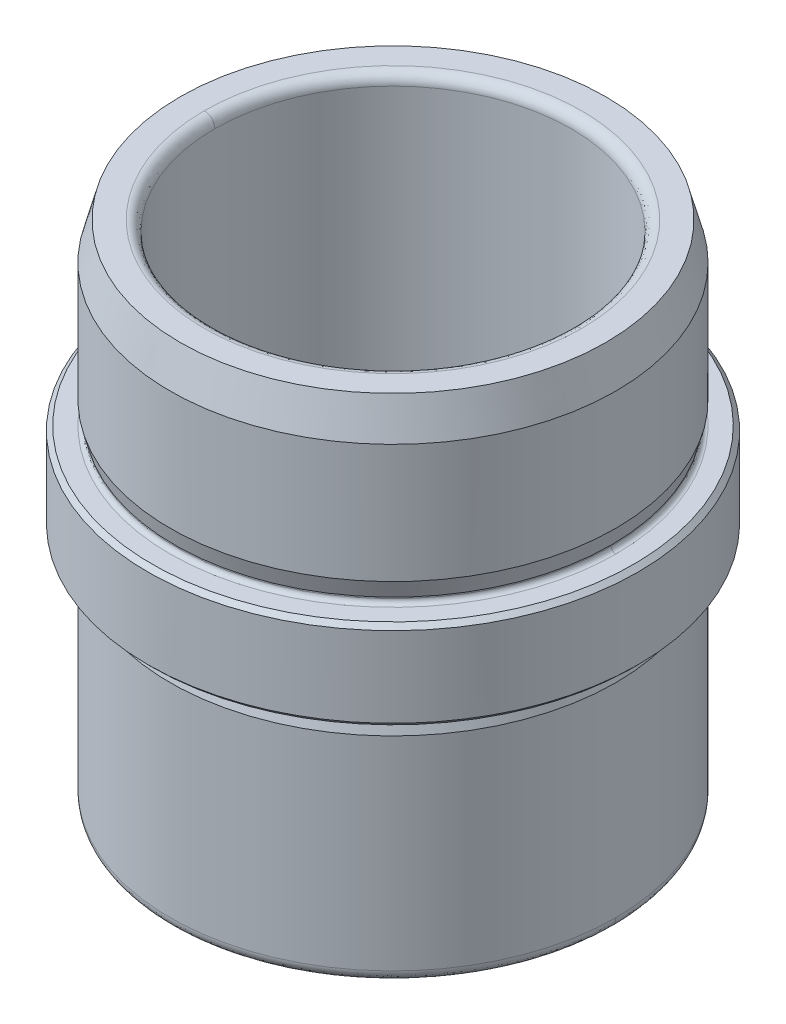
ISO-10303-21;
HEADER;
FILE_DESCRIPTION(('STEP AP214'),'2;1');
FILE_NAME('part.step','',(''),(''),'','','');
FILE_SCHEMA(('AUTOMOTIVE_DESIGN { 1 0 10303 214 1 1 1 1 }'));
ENDSEC;
DATA;
#1=APPLICATION_CONTEXT('core data for automotive mechanical design processes');
#2=APPLICATION_PROTOCOL_DEFINITION('international standard','automotive_design',2000,#1);
#3=PRODUCT_CONTEXT('',#1,'mechanical');
#4=PRODUCT('Part','Part','',(#3));
#5=PRODUCT_RELATED_PRODUCT_CATEGORY('part','',(#4));
#6=PRODUCT_DEFINITION_FORMATION('','',#4);
#7=PRODUCT_DEFINITION_CONTEXT('part definition',#1,'design');
#8=PRODUCT_DEFINITION('design','',#6,#7);
#9=PRODUCT_DEFINITION_SHAPE('','',#8);
#10=(LENGTH_UNIT() NAMED_UNIT(*) SI_UNIT(.MILLI.,.METRE.));
#11=(NAMED_UNIT(*) PLANE_ANGLE_UNIT() SI_UNIT($,.RADIAN.));
#12=(NAMED_UNIT(*) SI_UNIT($,.STERADIAN.) SOLID_ANGLE_UNIT());
#13=UNCERTAINTY_MEASURE_WITH_UNIT(LENGTH_MEASURE(1.E-05),#10,'distance_accuracy_value','');
#14=(GEOMETRIC_REPRESENTATION_CONTEXT(3) GLOBAL_UNCERTAINTY_ASSIGNED_CONTEXT((#13)) GLOBAL_UNIT_ASSIGNED_CONTEXT((#10,
#11,#12)) REPRESENTATION_CONTEXT('',''));
#15=CARTESIAN_POINT('',(0.,0.,0.));
#16=DIRECTION('',(0.,0.,1.));
#17=DIRECTION('',(1.,0.,0.));
#18=AXIS2_PLACEMENT_3D('',#15,#16,#17);
#19=CARTESIAN_POINT('',(45.,-94.7,172.));
#20=DIRECTION('',(0.,-1.,0.));
#21=DIRECTION('',(0.,0.,-1.));
#22=AXIS2_PLACEMENT_3D('',#19,#20,#21);
#23=CYLINDRICAL_SURFACE('',#22,12.);
#24=CARTESIAN_POINT('',(45.,-94.6999999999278,172.));
#25=DIRECTION('',(0.,-1.,0.));
#26=DIRECTION('',(0.,0.,-1.));
#27=AXIS2_PLACEMENT_3D('',#24,#25,#26);
#28=CIRCLE('',#27,11.9999999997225);
#29=CARTESIAN_POINT('',(56.9999999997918,-94.6999999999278,171.999999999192));
#30=VERTEX_POINT('',#29);
#31=CARTESIAN_POINT('',(33.0000000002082,-94.6999999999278,171.999999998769));
#32=VERTEX_POINT('',#31);
#33=EDGE_CURVE('E100',#30,#32,#28,.T.);
#34=ORIENTED_EDGE('',*,*,#33,.F.);
#35=CARTESIAN_POINT('',(45.,-94.6999999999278,172.));
#36=DIRECTION('',(0.,-1.,0.));
#37=DIRECTION('',(0.,0.,-1.));
#38=AXIS2_PLACEMENT_3D('',#35,#36,#37);
#39=CIRCLE('',#38,11.9999999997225);
#40=EDGE_CURVE('E520',#32,#30,#39,.T.);
#41=ORIENTED_EDGE('',*,*,#40,.F.);
#42=EDGE_LOOP('',(#34,#41));
#43=FACE_BOUND('',#42,.T.);
#44=CARTESIAN_POINT('',(45.,-127.000000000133,172.));
#45=DIRECTION('',(0.,1.,0.));
#46=DIRECTION('',(0.,0.,1.));
#47=AXIS2_PLACEMENT_3D('',#44,#45,#46);
#48=CIRCLE('',#47,12.0000000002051);
#49=CARTESIAN_POINT('',(57.0000000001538,-127.0000000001,171.999999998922));
#50=VERTEX_POINT('',#49);
#51=CARTESIAN_POINT('',(32.9999999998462,-127.0000000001,171.999999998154));
#52=VERTEX_POINT('',#51);
#53=EDGE_CURVE('E116',#50,#52,#48,.T.);
#54=ORIENTED_EDGE('',*,*,#53,.F.);
#55=CARTESIAN_POINT('',(45.,-127.000000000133,172.));
#56=DIRECTION('',(0.,1.,0.));
#57=DIRECTION('',(0.,0.,1.));
#58=AXIS2_PLACEMENT_3D('',#55,#56,#57);
#59=CIRCLE('',#58,12.0000000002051);
#60=EDGE_CURVE('E105',#52,#50,#59,.T.);
#61=ORIENTED_EDGE('',*,*,#60,.F.);
#62=EDGE_LOOP('',(#54,#61));
#63=FACE_BOUND('',#62,.T.);
#64=ADVANCED_FACE('F24',(#43,#63),#23,.F.);
#65=CARTESIAN_POINT('',(31.900166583,-127.995004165,172.));
#66=CARTESIAN_POINT('',(31.900166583,-127.995004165,198.199666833));
#67=CARTESIAN_POINT('',(58.099833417,-127.995004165,198.199666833));
#68=CARTESIAN_POINT('',(58.099833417,-127.995004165,172.));
#69=CARTESIAN_POINT('',(32.580053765,-128.063220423,172.));
#70=CARTESIAN_POINT('',(32.580053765,-128.063220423,196.83989247));
#71=CARTESIAN_POINT('',(57.419946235,-128.063220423,196.83989247));
#72=CARTESIAN_POINT('',(57.419946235,-128.063220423,172.));
#73=CARTESIAN_POINT('',(33.063220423,-127.580053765,172.));
#74=CARTESIAN_POINT('',(33.063220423,-127.580053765,195.873559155));
#75=CARTESIAN_POINT('',(56.936779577,-127.580053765,195.873559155));
#76=CARTESIAN_POINT('',(56.936779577,-127.580053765,172.));
#77=CARTESIAN_POINT('',(32.995004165,-126.900166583,172.));
#78=CARTESIAN_POINT('',(32.995004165,-126.900166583,196.009991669));
#79=CARTESIAN_POINT('',(57.004995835,-126.900166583,196.009991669));
#80=CARTESIAN_POINT('',(57.004995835,-126.900166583,172.));
#81=(BOUNDED_SURFACE() B_SPLINE_SURFACE(3,3,((#65,#66,#67,#68),(#69,#70,#71,#72),(#73,#74,#75,
#76),(#77,#78,#79,#80)),.UNSPECIFIED.,.F.,.F.,.F.) B_SPLINE_SURFACE_WITH_KNOTS((4,4),(4,4),(0.,
1.),(0.,1.),.UNSPECIFIED.) GEOMETRIC_REPRESENTATION_ITEM() RATIONAL_B_SPLINE_SURFACE(((1.,
0.333333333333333,0.333333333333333,1.),(0.755320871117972,0.251773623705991,0.251773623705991,
0.755320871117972),(0.755320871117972,0.251773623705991,0.251773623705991,0.755320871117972),
(1.,0.333333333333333,0.333333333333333,1.))) REPRESENTATION_ITEM('') SURFACE());
#82=CARTESIAN_POINT('',(58.099833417,-127.995004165,172.));
#83=CARTESIAN_POINT('',(57.419946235,-128.063220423,172.));
#84=CARTESIAN_POINT('',(56.936779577,-127.580053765,172.));
#85=CARTESIAN_POINT('',(57.004995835,-126.900166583,172.));
#86=(BOUNDED_CURVE() B_SPLINE_CURVE(3,(#82,#83,#84,#85),.UNSPECIFIED.,.F.,
.F.) B_SPLINE_CURVE_WITH_KNOTS((4,4),(0.,1.),
.UNSPECIFIED.) CURVE() GEOMETRIC_REPRESENTATION_ITEM() RATIONAL_B_SPLINE_CURVE((1.,
0.755320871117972,0.755320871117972,1.)) REPRESENTATION_ITEM(''));
#87=CARTESIAN_POINT('',(57.9999999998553,-127.999999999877,172.));
#88=VERTEX_POINT('',#87);
#89=EDGE_CURVE('E109',#88,#50,#86,.T.);
#90=CARTESIAN_POINT('',(58.0000000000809,-127.999999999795,172.));
#91=CARTESIAN_POINT('',(58.000000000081,-127.999999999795,197.999999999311));
#92=CARTESIAN_POINT('',(31.9999999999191,-127.999999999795,197.999999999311));
#93=CARTESIAN_POINT('',(31.9999999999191,-127.999999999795,172.));
#94=(BOUNDED_CURVE() B_SPLINE_CURVE(3,(#90,#91,#92,#93),.UNSPECIFIED.,.F.,
.F.) B_SPLINE_CURVE_WITH_KNOTS((4,4),(0.,1.),
.UNSPECIFIED.) CURVE() GEOMETRIC_REPRESENTATION_ITEM() RATIONAL_B_SPLINE_CURVE((0.956578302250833,
0.318859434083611,0.318859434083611,0.956578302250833)) REPRESENTATION_ITEM(''));
#95=CARTESIAN_POINT('',(32.0000000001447,-127.999999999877,172.));
#96=VERTEX_POINT('',#95);
#97=EDGE_CURVE('E139',#96,#88,#94,.F.);
#98=CARTESIAN_POINT('',(31.900166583,-127.995004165,172.));
#99=CARTESIAN_POINT('',(32.580053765,-128.063220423,172.));
#100=CARTESIAN_POINT('',(33.063220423,-127.580053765,172.));
#101=CARTESIAN_POINT('',(32.995004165,-126.900166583,172.));
#102=(BOUNDED_CURVE() B_SPLINE_CURVE(3,(#98,#99,#100,#101),.UNSPECIFIED.,.F.,
.F.) B_SPLINE_CURVE_WITH_KNOTS((4,4),(0.,1.),
.UNSPECIFIED.) CURVE() GEOMETRIC_REPRESENTATION_ITEM() RATIONAL_B_SPLINE_CURVE((1.,
0.755320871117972,0.755320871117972,1.)) REPRESENTATION_ITEM(''));
#103=EDGE_CURVE('E112',#52,#96,#102,.F.);
#104=ORIENTED_EDGE('',*,*,#89,.F.);
#105=ORIENTED_EDGE('',*,*,#97,.F.);
#106=ORIENTED_EDGE('',*,*,#103,.F.);
#107=ORIENTED_EDGE('',*,*,#60,.T.);
#108=EDGE_LOOP('',(#104,#105,#106,#107));
#109=FACE_BOUND('',#108,.T.);
#110=ADVANCED_FACE('F107',(#109),#81,.T.);
#111=CARTESIAN_POINT('',(58.099833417,-127.995004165,172.));
#112=CARTESIAN_POINT('',(58.099833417,-127.995004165,145.800333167));
#113=CARTESIAN_POINT('',(31.900166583,-127.995004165,145.800333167));
#114=CARTESIAN_POINT('',(31.900166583,-127.995004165,172.));
#115=CARTESIAN_POINT('',(57.419946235,-128.063220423,172.));
#116=CARTESIAN_POINT('',(57.419946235,-128.063220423,147.16010753));
#117=CARTESIAN_POINT('',(32.580053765,-128.063220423,147.16010753));
#118=CARTESIAN_POINT('',(32.580053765,-128.063220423,172.));
#119=CARTESIAN_POINT('',(56.936779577,-127.580053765,172.));
#120=CARTESIAN_POINT('',(56.936779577,-127.580053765,148.126440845));
#121=CARTESIAN_POINT('',(33.063220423,-127.580053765,148.126440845));
#122=CARTESIAN_POINT('',(33.063220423,-127.580053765,172.));
#123=CARTESIAN_POINT('',(57.004995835,-126.900166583,172.));
#124=CARTESIAN_POINT('',(57.004995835,-126.900166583,147.990008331));
#125=CARTESIAN_POINT('',(32.995004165,-126.900166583,147.990008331));
#126=CARTESIAN_POINT('',(32.995004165,-126.900166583,172.));
#127=(BOUNDED_SURFACE() B_SPLINE_SURFACE(3,3,((#111,#112,#113,#114),(#115,#116,#117,#118),(#119,
#120,#121,#122),(#123,#124,#125,#126)),.UNSPECIFIED.,.F.,.F.,
.F.) B_SPLINE_SURFACE_WITH_KNOTS((4,4),(4,4),(0.,1.),(0.,1.),
.UNSPECIFIED.) GEOMETRIC_REPRESENTATION_ITEM() RATIONAL_B_SPLINE_SURFACE(((1.,0.333333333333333,
0.333333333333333,1.),(0.755320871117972,0.251773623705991,0.251773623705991,0.755320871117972),
(0.755320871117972,0.251773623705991,0.251773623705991,0.755320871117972),(1.,0.333333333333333,
0.333333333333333,1.))) REPRESENTATION_ITEM('') SURFACE());
#128=CARTESIAN_POINT('',(31.9999999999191,-127.999999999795,172.));
#129=CARTESIAN_POINT('',(31.9999999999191,-127.999999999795,146.000000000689));
#130=CARTESIAN_POINT('',(58.0000000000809,-127.999999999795,146.000000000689));
#131=CARTESIAN_POINT('',(58.0000000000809,-127.999999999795,172.));
#132=(BOUNDED_CURVE() B_SPLINE_CURVE(3,(#128,#129,#130,#131),.UNSPECIFIED.,.F.,
.F.) B_SPLINE_CURVE_WITH_KNOTS((4,4),(0.,1.),
.UNSPECIFIED.) CURVE() GEOMETRIC_REPRESENTATION_ITEM() RATIONAL_B_SPLINE_CURVE((0.956578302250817,
0.318859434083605,0.318859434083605,0.956578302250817)) REPRESENTATION_ITEM(''));
#133=EDGE_CURVE('E121',#88,#96,#132,.F.);
#134=ORIENTED_EDGE('',*,*,#89,.T.);
#135=ORIENTED_EDGE('',*,*,#53,.T.);
#136=ORIENTED_EDGE('',*,*,#103,.T.);
#137=ORIENTED_EDGE('',*,*,#133,.F.);
#138=EDGE_LOOP('',(#134,#135,#136,#137));
#139=FACE_BOUND('',#138,.T.);
#140=ADVANCED_FACE('F119',(#139),#127,.T.);
#141=CARTESIAN_POINT('',(57.769883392,-94.003497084,172.));
#142=CARTESIAN_POINT('',(57.769883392,-94.003497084,197.539766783));
#143=CARTESIAN_POINT('',(32.230116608,-94.003497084,197.539766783));
#144=CARTESIAN_POINT('',(32.230116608,-94.003497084,172.));
#145=CARTESIAN_POINT('',(57.293962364,-93.955745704,172.));
#146=CARTESIAN_POINT('',(57.293962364,-93.955745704,196.587924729));
#147=CARTESIAN_POINT('',(32.706037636,-93.955745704,196.587924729));
#148=CARTESIAN_POINT('',(32.706037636,-93.955745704,172.));
#149=CARTESIAN_POINT('',(56.955745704,-94.293962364,172.));
#150=CARTESIAN_POINT('',(56.955745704,-94.293962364,195.911491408));
#151=CARTESIAN_POINT('',(33.044254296,-94.293962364,195.911491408));
#152=CARTESIAN_POINT('',(33.044254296,-94.293962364,172.));
#153=CARTESIAN_POINT('',(57.003497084,-94.769883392,172.));
#154=CARTESIAN_POINT('',(57.003497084,-94.769883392,196.006994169));
#155=CARTESIAN_POINT('',(32.996502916,-94.769883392,196.006994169));
#156=CARTESIAN_POINT('',(32.996502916,-94.769883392,172.));
#157=(BOUNDED_SURFACE() B_SPLINE_SURFACE(3,3,((#141,#142,#143,#144),(#145,#146,#147,#148),(#149,
#150,#151,#152),(#153,#154,#155,#156)),.UNSPECIFIED.,.F.,.F.,
.F.) B_SPLINE_SURFACE_WITH_KNOTS((4,4),(4,4),(0.,1.),(0.,1.),
.UNSPECIFIED.) GEOMETRIC_REPRESENTATION_ITEM() RATIONAL_B_SPLINE_SURFACE(((1.,0.333333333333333,
0.333333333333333,1.),(0.755320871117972,0.251773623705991,0.251773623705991,0.755320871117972),
(0.755320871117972,0.251773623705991,0.251773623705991,0.755320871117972),(1.,0.333333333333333,
0.333333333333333,1.))) REPRESENTATION_ITEM('') SURFACE());
#158=CARTESIAN_POINT('',(32.230116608,-94.003497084,172.));
#159=CARTESIAN_POINT('',(32.706037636,-93.955745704,172.));
#160=CARTESIAN_POINT('',(33.044254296,-94.293962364,172.));
#161=CARTESIAN_POINT('',(32.996502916,-94.769883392,172.));
#162=(BOUNDED_CURVE() B_SPLINE_CURVE(3,(#158,#159,#160,#161),.UNSPECIFIED.,.F.,
.F.) B_SPLINE_CURVE_WITH_KNOTS((4,4),(0.,1.),
.UNSPECIFIED.) CURVE() GEOMETRIC_REPRESENTATION_ITEM() RATIONAL_B_SPLINE_CURVE((1.,
0.755320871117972,0.755320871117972,1.)) REPRESENTATION_ITEM(''));
#163=CARTESIAN_POINT('',(32.3000000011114,-93.9999999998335,172.));
#164=VERTEX_POINT('',#163);
#165=EDGE_CURVE('E511',#164,#32,#162,.T.);
#166=CARTESIAN_POINT('',(32.299999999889,-93.9999999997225,172.));
#167=CARTESIAN_POINT('',(32.2999999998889,-93.9999999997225,197.399999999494));
#168=CARTESIAN_POINT('',(57.700000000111,-93.9999999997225,197.399999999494));
#169=CARTESIAN_POINT('',(57.7000000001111,-93.9999999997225,172.));
#170=(BOUNDED_CURVE() B_SPLINE_CURVE(3,(#166,#167,#168,#169),.UNSPECIFIED.,.F.,
.F.) B_SPLINE_CURVE_WITH_KNOTS((4,4),(0.,1.),
.UNSPECIFIED.) CURVE() GEOMETRIC_REPRESENTATION_ITEM() RATIONAL_B_SPLINE_CURVE((0.956578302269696,
0.318859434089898,0.318859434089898,0.956578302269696)) REPRESENTATION_ITEM(''));
#171=CARTESIAN_POINT('',(57.6999999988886,-93.9999999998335,172.));
#172=VERTEX_POINT('',#171);
#173=EDGE_CURVE('E213',#164,#172,#170,.T.);
#174=CARTESIAN_POINT('',(57.769883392,-94.003497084,172.));
#175=CARTESIAN_POINT('',(57.293962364,-93.955745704,172.));
#176=CARTESIAN_POINT('',(56.955745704,-94.293962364,172.));
#177=CARTESIAN_POINT('',(57.003497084,-94.769883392,172.));
#178=(BOUNDED_CURVE() B_SPLINE_CURVE(3,(#174,#175,#176,#177),.UNSPECIFIED.,.F.,
.F.) B_SPLINE_CURVE_WITH_KNOTS((4,4),(0.,1.),
.UNSPECIFIED.) CURVE() GEOMETRIC_REPRESENTATION_ITEM() RATIONAL_B_SPLINE_CURVE((1.,
0.755320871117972,0.755320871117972,1.)) REPRESENTATION_ITEM(''));
#179=EDGE_CURVE('E504',#30,#172,#178,.F.);
#180=ORIENTED_EDGE('',*,*,#165,.F.);
#181=ORIENTED_EDGE('',*,*,#173,.T.);
#182=ORIENTED_EDGE('',*,*,#179,.F.);
#183=ORIENTED_EDGE('',*,*,#33,.T.);
#184=EDGE_LOOP('',(#180,#181,#182,#183));
#185=FACE_BOUND('',#184,.T.);
#186=ADVANCED_FACE('F533',(#185),#157,.T.);
#187=CARTESIAN_POINT('',(32.230116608,-94.003497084,172.));
#188=CARTESIAN_POINT('',(32.230116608,-94.003497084,146.460233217));
#189=CARTESIAN_POINT('',(57.769883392,-94.003497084,146.460233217));
#190=CARTESIAN_POINT('',(57.769883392,-94.003497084,172.));
#191=CARTESIAN_POINT('',(32.706037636,-93.955745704,172.));
#192=CARTESIAN_POINT('',(32.706037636,-93.955745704,147.412075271));
#193=CARTESIAN_POINT('',(57.293962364,-93.955745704,147.412075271));
#194=CARTESIAN_POINT('',(57.293962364,-93.955745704,172.));
#195=CARTESIAN_POINT('',(33.044254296,-94.293962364,172.));
#196=CARTESIAN_POINT('',(33.044254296,-94.293962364,148.088508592));
#197=CARTESIAN_POINT('',(56.955745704,-94.293962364,148.088508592));
#198=CARTESIAN_POINT('',(56.955745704,-94.293962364,172.));
#199=CARTESIAN_POINT('',(32.996502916,-94.769883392,172.));
#200=CARTESIAN_POINT('',(32.996502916,-94.769883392,147.993005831));
#201=CARTESIAN_POINT('',(57.003497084,-94.769883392,147.993005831));
#202=CARTESIAN_POINT('',(57.003497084,-94.769883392,172.));
#203=(BOUNDED_SURFACE() B_SPLINE_SURFACE(3,3,((#187,#188,#189,#190),(#191,#192,#193,#194),(#195,
#196,#197,#198),(#199,#200,#201,#202)),.UNSPECIFIED.,.F.,.F.,
.F.) B_SPLINE_SURFACE_WITH_KNOTS((4,4),(4,4),(0.,1.),(0.,1.),
.UNSPECIFIED.) GEOMETRIC_REPRESENTATION_ITEM() RATIONAL_B_SPLINE_SURFACE(((1.,0.333333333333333,
0.333333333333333,1.),(0.755320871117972,0.251773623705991,0.251773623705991,0.755320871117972),
(0.755320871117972,0.251773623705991,0.251773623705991,0.755320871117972),(1.,0.333333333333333,
0.333333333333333,1.))) REPRESENTATION_ITEM('') SURFACE());
#204=CARTESIAN_POINT('',(57.700000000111,-93.9999999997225,172.));
#205=CARTESIAN_POINT('',(57.700000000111,-93.9999999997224,146.600000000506));
#206=CARTESIAN_POINT('',(32.299999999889,-93.9999999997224,146.600000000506));
#207=CARTESIAN_POINT('',(32.299999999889,-93.9999999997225,172.));
#208=(BOUNDED_CURVE() B_SPLINE_CURVE(3,(#204,#205,#206,#207),.UNSPECIFIED.,.F.,
.F.) B_SPLINE_CURVE_WITH_KNOTS((4,4),(0.,1.),
.UNSPECIFIED.) CURVE() GEOMETRIC_REPRESENTATION_ITEM() RATIONAL_B_SPLINE_CURVE((0.956578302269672,
0.318859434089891,0.318859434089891,0.956578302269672)) REPRESENTATION_ITEM(''));
#209=EDGE_CURVE('E224',#172,#164,#208,.T.);
#210=ORIENTED_EDGE('',*,*,#165,.T.);
#211=ORIENTED_EDGE('',*,*,#40,.T.);
#212=ORIENTED_EDGE('',*,*,#179,.T.);
#213=ORIENTED_EDGE('',*,*,#209,.T.);
#214=EDGE_LOOP('',(#210,#211,#212,#213));
#215=FACE_BOUND('',#214,.T.);
#216=ADVANCED_FACE('F172',(#215),#203,.T.);
#217=CARTESIAN_POINT('',(59.3704,-128.,157.6296));
#218=DIRECTION('',(0.,-1.,0.));
#219=DIRECTION('',(0.,0.,1.));
#220=AXIS2_PLACEMENT_3D('',#217,#218,#219);
#221=PLANE('',#220);
#222=ORIENTED_EDGE('',*,*,#97,.T.);
#223=ORIENTED_EDGE('',*,*,#133,.T.);
#224=EDGE_LOOP('',(#222,#223));
#225=FACE_BOUND('',#224,.T.);
#226=CARTESIAN_POINT('',(30.7999999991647,-127.999999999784,172.));
#227=CARTESIAN_POINT('',(30.7999999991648,-127.999999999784,200.400000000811));
#228=CARTESIAN_POINT('',(59.2000000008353,-127.999999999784,200.400000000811));
#229=CARTESIAN_POINT('',(59.2000000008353,-127.999999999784,172.));
#230=(BOUNDED_CURVE() B_SPLINE_CURVE(3,(#226,#227,#228,#229),.UNSPECIFIED.,.F.,
.F.) B_SPLINE_CURVE_WITH_KNOTS((4,4),(0.,1.),
.UNSPECIFIED.) CURVE() GEOMETRIC_REPRESENTATION_ITEM() RATIONAL_B_SPLINE_CURVE((0.956578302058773,
0.318859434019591,0.318859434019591,0.956578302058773)) REPRESENTATION_ITEM(''));
#231=CARTESIAN_POINT('',(30.8000000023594,-127.99999999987,172.));
#232=VERTEX_POINT('',#231);
#233=CARTESIAN_POINT('',(59.1999999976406,-127.99999999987,172.));
#234=VERTEX_POINT('',#233);
#235=EDGE_CURVE('E429',#232,#234,#230,.T.);
#236=ORIENTED_EDGE('',*,*,#235,.F.);
#237=CARTESIAN_POINT('',(59.2000000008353,-127.999999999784,172.));
#238=CARTESIAN_POINT('',(59.2000000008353,-127.999999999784,143.599999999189));
#239=CARTESIAN_POINT('',(30.7999999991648,-127.999999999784,143.599999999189));
#240=CARTESIAN_POINT('',(30.7999999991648,-127.999999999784,172.));
#241=(BOUNDED_CURVE() B_SPLINE_CURVE(3,(#237,#238,#239,#240),.UNSPECIFIED.,.F.,
.F.) B_SPLINE_CURVE_WITH_KNOTS((4,4),(0.,1.),
.UNSPECIFIED.) CURVE() GEOMETRIC_REPRESENTATION_ITEM() RATIONAL_B_SPLINE_CURVE((0.956578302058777,
0.318859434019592,0.318859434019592,0.956578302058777)) REPRESENTATION_ITEM(''));
#242=EDGE_CURVE('E199',#234,#232,#241,.T.);
#243=ORIENTED_EDGE('',*,*,#242,.F.);
#244=EDGE_LOOP('',(#236,#243));
#245=FACE_BOUND('',#244,.T.);
#246=ADVANCED_FACE('F167',(#225,#245),#221,.T.);
#247=CARTESIAN_POINT('',(59.502088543,-94.,157.497911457));
#248=DIRECTION('',(0.,-1.,0.));
#249=DIRECTION('',(0.,0.,1.));
#250=AXIS2_PLACEMENT_3D('',#247,#248,#249);
#251=PLANE('',#250);
#252=ORIENTED_EDGE('',*,*,#173,.F.);
#253=ORIENTED_EDGE('',*,*,#209,.F.);
#254=EDGE_LOOP('',(#252,#253));
#255=FACE_BOUND('',#254,.T.);
#256=CARTESIAN_POINT('',(45.,-94.,172.));
#257=DIRECTION('',(0.,-1.,0.));
#258=DIRECTION('',(0.,0.,-1.));
#259=AXIS2_PLACEMENT_3D('',#256,#257,#258);
#260=CIRCLE('',#259,14.330127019);
#261=CARTESIAN_POINT('',(45.,-94.,157.669872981));
#262=VERTEX_POINT('',#261);
#263=EDGE_CURVE('E29',#262,#262,#260,.F.);
#264=ORIENTED_EDGE('',*,*,#263,.T.);
#265=EDGE_LOOP('',(#264));
#266=FACE_BOUND('',#265,.T.);
#267=ADVANCED_FACE('F171',(#255,#266),#251,.F.);
#268=CARTESIAN_POINT('',(59.996003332,-127.120133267,172.));
#269=CARTESIAN_POINT('',(59.996003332,-127.120133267,142.007993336));
#270=CARTESIAN_POINT('',(30.003996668,-127.120133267,142.007993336));
#271=CARTESIAN_POINT('',(30.003996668,-127.120133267,172.));
#272=CARTESIAN_POINT('',(60.050576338,-127.664043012,172.));
#273=CARTESIAN_POINT('',(60.050576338,-127.664043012,141.898847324));
#274=CARTESIAN_POINT('',(29.949423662,-127.664043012,141.898847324));
#275=CARTESIAN_POINT('',(29.949423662,-127.664043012,172.));
#276=CARTESIAN_POINT('',(59.664043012,-128.050576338,172.));
#277=CARTESIAN_POINT('',(59.664043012,-128.050576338,142.671913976));
#278=CARTESIAN_POINT('',(30.335956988,-128.050576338,142.671913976));
#279=CARTESIAN_POINT('',(30.335956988,-128.050576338,172.));
#280=CARTESIAN_POINT('',(59.120133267,-127.996003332,172.));
#281=CARTESIAN_POINT('',(59.120133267,-127.996003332,143.759733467));
#282=CARTESIAN_POINT('',(30.879866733,-127.996003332,143.759733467));
#283=CARTESIAN_POINT('',(30.879866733,-127.996003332,172.));
#284=(BOUNDED_SURFACE() B_SPLINE_SURFACE(3,3,((#268,#269,#270,#271),(#272,#273,#274,#275),(#276,
#277,#278,#279),(#280,#281,#282,#283)),.UNSPECIFIED.,.F.,.F.,
.F.) B_SPLINE_SURFACE_WITH_KNOTS((4,4),(4,4),(0.,1.),(0.,1.),
.UNSPECIFIED.) GEOMETRIC_REPRESENTATION_ITEM() RATIONAL_B_SPLINE_SURFACE(((1.,0.333333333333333,
0.333333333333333,1.),(0.755320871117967,0.251773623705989,0.251773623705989,0.755320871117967),
(0.755320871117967,0.251773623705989,0.251773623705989,0.755320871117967),(1.,0.333333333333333,
0.333333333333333,1.))) REPRESENTATION_ITEM('') SURFACE());
#285=CARTESIAN_POINT('',(45.,-127.2,172.));
#286=DIRECTION('',(0.,-1.,0.));
#287=DIRECTION('',(1.,0.,0.));
#288=AXIS2_PLACEMENT_3D('',#285,#286,#287);
#289=CIRCLE('',#288,15.);
#290=CARTESIAN_POINT('',(30.0000000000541,-127.200000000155,171.999999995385));
#291=VERTEX_POINT('',#290);
#292=CARTESIAN_POINT('',(59.9999999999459,-127.2,171.999999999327));
#293=VERTEX_POINT('',#292);
#294=EDGE_CURVE('E422',#291,#293,#289,.T.);
#295=CARTESIAN_POINT('',(59.996003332,-127.120133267,172.));
#296=CARTESIAN_POINT('',(60.050576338,-127.664043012,172.));
#297=CARTESIAN_POINT('',(59.664043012,-128.050576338,172.));
#298=CARTESIAN_POINT('',(59.120133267,-127.996003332,172.));
#299=(BOUNDED_CURVE() B_SPLINE_CURVE(3,(#295,#296,#297,#298),.UNSPECIFIED.,.F.,
.F.) B_SPLINE_CURVE_WITH_KNOTS((4,4),(0.,1.),
.UNSPECIFIED.) CURVE() GEOMETRIC_REPRESENTATION_ITEM() RATIONAL_B_SPLINE_CURVE((1.,
0.755320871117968,0.755320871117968,1.)) REPRESENTATION_ITEM(''));
#300=EDGE_CURVE('E434',#234,#293,#299,.F.);
#301=CARTESIAN_POINT('',(30.003996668,-127.120133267,172.));
#302=CARTESIAN_POINT('',(29.949423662,-127.664043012,172.));
#303=CARTESIAN_POINT('',(30.335956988,-128.050576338,172.));
#304=CARTESIAN_POINT('',(30.879866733,-127.996003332,172.));
#305=(BOUNDED_CURVE() B_SPLINE_CURVE(3,(#301,#302,#303,#304),.UNSPECIFIED.,.F.,
.F.) B_SPLINE_CURVE_WITH_KNOTS((4,4),(0.,1.),
.UNSPECIFIED.) CURVE() GEOMETRIC_REPRESENTATION_ITEM() RATIONAL_B_SPLINE_CURVE((1.,
0.755320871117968,0.755320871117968,1.)) REPRESENTATION_ITEM(''));
#306=EDGE_CURVE('E426',#291,#232,#305,.T.);
#307=ORIENTED_EDGE('',*,*,#294,.T.);
#308=ORIENTED_EDGE('',*,*,#300,.F.);
#309=ORIENTED_EDGE('',*,*,#242,.T.);
#310=ORIENTED_EDGE('',*,*,#306,.F.);
#311=EDGE_LOOP('',(#307,#308,#309,#310));
#312=FACE_BOUND('',#311,.T.);
#313=ADVANCED_FACE('F468',(#312),#284,.T.);
#314=CARTESIAN_POINT('',(30.003996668,-127.120133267,172.));
#315=CARTESIAN_POINT('',(30.003996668,-127.120133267,201.992006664));
#316=CARTESIAN_POINT('',(59.996003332,-127.120133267,201.992006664));
#317=CARTESIAN_POINT('',(59.996003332,-127.120133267,172.));
#318=CARTESIAN_POINT('',(29.949423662,-127.664043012,172.));
#319=CARTESIAN_POINT('',(29.949423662,-127.664043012,202.101152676));
#320=CARTESIAN_POINT('',(60.050576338,-127.664043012,202.101152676));
#321=CARTESIAN_POINT('',(60.050576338,-127.664043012,172.));
#322=CARTESIAN_POINT('',(30.335956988,-128.050576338,172.));
#323=CARTESIAN_POINT('',(30.335956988,-128.050576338,201.328086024));
#324=CARTESIAN_POINT('',(59.664043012,-128.050576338,201.328086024));
#325=CARTESIAN_POINT('',(59.664043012,-128.050576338,172.));
#326=CARTESIAN_POINT('',(30.879866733,-127.996003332,172.));
#327=CARTESIAN_POINT('',(30.879866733,-127.996003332,200.240266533));
#328=CARTESIAN_POINT('',(59.120133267,-127.996003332,200.240266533));
#329=CARTESIAN_POINT('',(59.120133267,-127.996003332,172.));
#330=(BOUNDED_SURFACE() B_SPLINE_SURFACE(3,3,((#314,#315,#316,#317),(#318,#319,#320,#321),(#322,
#323,#324,#325),(#326,#327,#328,#329)),.UNSPECIFIED.,.F.,.F.,
.F.) B_SPLINE_SURFACE_WITH_KNOTS((4,4),(4,4),(0.,1.),(0.,1.),
.UNSPECIFIED.) GEOMETRIC_REPRESENTATION_ITEM() RATIONAL_B_SPLINE_SURFACE(((1.,0.333333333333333,
0.333333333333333,1.),(0.755320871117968,0.251773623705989,0.251773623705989,0.755320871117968),
(0.755320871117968,0.251773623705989,0.251773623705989,0.755320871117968),(1.,0.333333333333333,
0.333333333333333,1.))) REPRESENTATION_ITEM('') SURFACE());
#331=CARTESIAN_POINT('',(45.,-127.2,172.));
#332=DIRECTION('',(0.,-1.,0.));
#333=DIRECTION('',(1.,0.,0.));
#334=AXIS2_PLACEMENT_3D('',#331,#332,#333);
#335=CIRCLE('',#334,15.);
#336=EDGE_CURVE('E421',#293,#291,#335,.T.);
#337=ORIENTED_EDGE('',*,*,#300,.T.);
#338=ORIENTED_EDGE('',*,*,#336,.T.);
#339=ORIENTED_EDGE('',*,*,#306,.T.);
#340=ORIENTED_EDGE('',*,*,#235,.T.);
#341=EDGE_LOOP('',(#337,#338,#339,#340));
#342=FACE_BOUND('',#341,.T.);
#343=ADVANCED_FACE('F455',(#342),#330,.T.);
#344=CARTESIAN_POINT('',(45.,-94.,172.));
#345=DIRECTION('',(0.,-1.,0.));
#346=DIRECTION('',(0.,0.,-1.));
#347=AXIS2_PLACEMENT_3D('',#344,#345,#346);
#348=CONICAL_SURFACE('',#347,14.330127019,0.261799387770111);
#349=ORIENTED_EDGE('',*,*,#263,.F.);
#350=EDGE_LOOP('',(#349));
#351=FACE_BOUND('',#350,.T.);
#352=CARTESIAN_POINT('',(45.,-96.5,172.));
#353=DIRECTION('',(0.,-1.,0.));
#354=DIRECTION('',(1.,0.,0.));
#355=AXIS2_PLACEMENT_3D('',#352,#353,#354);
#356=CIRCLE('',#355,15.);
#357=CARTESIAN_POINT('',(60.,-96.5,172.));
#358=VERTEX_POINT('',#357);
#359=EDGE_CURVE('E418',#358,#358,#356,.F.);
#360=ORIENTED_EDGE('',*,*,#359,.T.);
#361=EDGE_LOOP('',(#360));
#362=FACE_BOUND('',#361,.T.);
#363=ADVANCED_FACE('F467',(#351,#362),#348,.T.);
#364=CARTESIAN_POINT('',(45.,-113.5,172.));
#365=DIRECTION('',(0.,-1.,0.));
#366=DIRECTION('',(0.,0.,-1.));
#367=AXIS2_PLACEMENT_3D('',#364,#365,#366);
#368=CYLINDRICAL_SURFACE('',#367,15.);
#369=ORIENTED_EDGE('',*,*,#336,.F.);
#370=ORIENTED_EDGE('',*,*,#294,.F.);
#371=EDGE_LOOP('',(#369,#370));
#372=FACE_BOUND('',#371,.T.);
#373=CARTESIAN_POINT('',(45.,-113.5,172.));
#374=DIRECTION('',(0.,-1.,0.));
#375=DIRECTION('',(1.,0.,0.));
#376=AXIS2_PLACEMENT_3D('',#373,#374,#375);
#377=CIRCLE('',#376,15.);
#378=CARTESIAN_POINT('',(60.,-113.5,172.));
#379=VERTEX_POINT('',#378);
#380=EDGE_CURVE('E415',#379,#379,#377,.T.);
#381=ORIENTED_EDGE('',*,*,#380,.T.);
#382=EDGE_LOOP('',(#381));
#383=FACE_BOUND('',#382,.T.);
#384=ADVANCED_FACE('F642',(#372,#383),#368,.T.);
#385=CARTESIAN_POINT('',(45.,-96.5,172.));
#386=DIRECTION('',(0.,-1.,0.));
#387=DIRECTION('',(0.,0.,-1.));
#388=AXIS2_PLACEMENT_3D('',#385,#386,#387);
#389=CYLINDRICAL_SURFACE('',#388,15.);
#390=ORIENTED_EDGE('',*,*,#359,.F.);
#391=EDGE_LOOP('',(#390));
#392=FACE_BOUND('',#391,.T.);
#393=CARTESIAN_POINT('',(45.,-104.5,172.));
#394=DIRECTION('',(0.,1.,0.));
#395=DIRECTION('',(1.,0.,0.));
#396=AXIS2_PLACEMENT_3D('',#393,#394,#395);
#397=CIRCLE('',#396,15.);
#398=CARTESIAN_POINT('',(60.,-104.5,172.));
#399=VERTEX_POINT('',#398);
#400=EDGE_CURVE('E412',#399,#399,#397,.T.);
#401=ORIENTED_EDGE('',*,*,#400,.T.);
#402=EDGE_LOOP('',(#401));
#403=FACE_BOUND('',#402,.T.);
#404=ADVANCED_FACE('F634',(#392,#403),#389,.T.);
#405=CARTESIAN_POINT('',(45.,-112.380384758,172.));
#406=DIRECTION('',(0.,-1.,0.));
#407=DIRECTION('',(0.,0.,-1.));
#408=AXIS2_PLACEMENT_3D('',#405,#406,#407);
#409=CONICAL_SURFACE('',#408,14.7,0.26179938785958);
#410=ORIENTED_EDGE('',*,*,#380,.F.);
#411=EDGE_LOOP('',(#410));
#412=FACE_BOUND('',#411,.T.);
#413=CARTESIAN_POINT('',(45.,-112.380384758,172.));
#414=DIRECTION('',(0.,1.,0.));
#415=DIRECTION('',(-1.,0.,0.));
#416=AXIS2_PLACEMENT_3D('',#413,#414,#415);
#417=CIRCLE('',#416,14.7);
#418=CARTESIAN_POINT('',(30.3,-112.380384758,172.));
#419=VERTEX_POINT('',#418);
#420=EDGE_CURVE('E409',#419,#419,#417,.F.);
#421=ORIENTED_EDGE('',*,*,#420,.T.);
#422=EDGE_LOOP('',(#421));
#423=FACE_BOUND('',#422,.T.);
#424=ADVANCED_FACE('F626',(#412,#423),#409,.T.);
#425=CARTESIAN_POINT('',(45.,-105.619615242,172.));
#426=DIRECTION('',(0.,1.,0.));
#427=DIRECTION('',(0.,0.,1.));
#428=AXIS2_PLACEMENT_3D('',#425,#426,#427);
#429=CONICAL_SURFACE('',#428,14.7,0.261799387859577);
#430=ORIENTED_EDGE('',*,*,#400,.F.);
#431=EDGE_LOOP('',(#430));
#432=FACE_BOUND('',#431,.T.);
#433=CARTESIAN_POINT('',(45.,-105.619615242,172.));
#434=DIRECTION('',(0.,-1.,0.));
#435=DIRECTION('',(1.,0.,0.));
#436=AXIS2_PLACEMENT_3D('',#433,#434,#435);
#437=CIRCLE('',#436,14.7);
#438=CARTESIAN_POINT('',(59.7,-105.619615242,172.));
#439=VERTEX_POINT('',#438);
#440=EDGE_CURVE('E405',#439,#439,#437,.F.);
#441=ORIENTED_EDGE('',*,*,#440,.T.);
#442=EDGE_LOOP('',(#441));
#443=FACE_BOUND('',#442,.T.);
#444=ADVANCED_FACE('F618',(#432,#443),#429,.T.);
#445=CARTESIAN_POINT('',(45.,-112.380384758,172.));
#446=DIRECTION('',(0.,1.,0.));
#447=DIRECTION('',(0.,0.,1.));
#448=AXIS2_PLACEMENT_3D('',#445,#446,#447);
#449=CYLINDRICAL_SURFACE('',#448,14.7);
#450=CARTESIAN_POINT('',(45.,-112.299999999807,172.));
#451=DIRECTION('',(0.,-1.,0.));
#452=DIRECTION('',(0.,0.,-1.));
#453=AXIS2_PLACEMENT_3D('',#450,#451,#452);
#454=CIRCLE('',#453,14.6999999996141);
#455=CARTESIAN_POINT('',(59.6999999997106,-112.299999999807,171.999999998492));
#456=VERTEX_POINT('',#455);
#457=CARTESIAN_POINT('',(30.3000000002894,-112.299999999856,172.));
#458=VERTEX_POINT('',#457);
#459=EDGE_CURVE('E377',#456,#458,#454,.T.);
#460=ORIENTED_EDGE('',*,*,#459,.T.);
#461=CARTESIAN_POINT('',(45.,-112.299999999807,172.));
#462=DIRECTION('',(0.,-1.,0.));
#463=DIRECTION('',(0.,0.,-1.));
#464=AXIS2_PLACEMENT_3D('',#461,#462,#463);
#465=CIRCLE('',#464,14.6999999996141);
#466=EDGE_CURVE('E387',#458,#456,#465,.T.);
#467=ORIENTED_EDGE('',*,*,#466,.T.);
#468=EDGE_LOOP('',(#460,#467));
#469=FACE_BOUND('',#468,.T.);
#470=ORIENTED_EDGE('',*,*,#420,.F.);
#471=EDGE_LOOP('',(#470));
#472=FACE_BOUND('',#471,.T.);
#473=ADVANCED_FACE('F611',(#469,#472),#449,.T.);
#474=CARTESIAN_POINT('',(45.,-105.619615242,172.));
#475=DIRECTION('',(0.,-1.,0.));
#476=DIRECTION('',(0.,0.,-1.));
#477=AXIS2_PLACEMENT_3D('',#474,#475,#476);
#478=CYLINDRICAL_SURFACE('',#477,14.7);
#479=CARTESIAN_POINT('',(45.,-105.700000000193,172.));
#480=DIRECTION('',(0.,1.,0.));
#481=DIRECTION('',(0.,0.,1.));
#482=AXIS2_PLACEMENT_3D('',#479,#480,#481);
#483=CIRCLE('',#482,14.6999999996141);
#484=CARTESIAN_POINT('',(59.6999999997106,-105.700000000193,171.99999999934));
#485=VERTEX_POINT('',#484);
#486=CARTESIAN_POINT('',(30.3000000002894,-105.700000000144,171.999999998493));
#487=VERTEX_POINT('',#486);
#488=EDGE_CURVE('E301',#485,#487,#483,.T.);
#489=ORIENTED_EDGE('',*,*,#488,.T.);
#490=CARTESIAN_POINT('',(45.,-105.700000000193,172.));
#491=DIRECTION('',(0.,1.,0.));
#492=DIRECTION('',(0.,0.,1.));
#493=AXIS2_PLACEMENT_3D('',#490,#491,#492);
#494=CIRCLE('',#493,14.6999999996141);
#495=EDGE_CURVE('E319',#487,#485,#494,.T.);
#496=ORIENTED_EDGE('',*,*,#495,.T.);
#497=EDGE_LOOP('',(#489,#496));
#498=FACE_BOUND('',#497,.T.);
#499=ORIENTED_EDGE('',*,*,#440,.F.);
#500=EDGE_LOOP('',(#499));
#501=FACE_BOUND('',#500,.T.);
#502=ADVANCED_FACE('F605',(#498,#501),#478,.T.);
#503=CARTESIAN_POINT('',(29.970049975,-112.00149875,172.));
#504=CARTESIAN_POINT('',(29.970049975,-112.00149875,141.94009995));
#505=CARTESIAN_POINT('',(60.029950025,-112.00149875,141.94009995));
#506=CARTESIAN_POINT('',(60.029950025,-112.00149875,172.));
#507=CARTESIAN_POINT('',(30.17401613,-111.981033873,172.));
#508=CARTESIAN_POINT('',(30.17401613,-111.981033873,142.348032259));
#509=CARTESIAN_POINT('',(59.82598387,-111.981033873,142.348032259));
#510=CARTESIAN_POINT('',(59.82598387,-111.981033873,172.));
#511=CARTESIAN_POINT('',(30.318966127,-112.12598387,172.));
#512=CARTESIAN_POINT('',(30.318966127,-112.12598387,142.637932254));
#513=CARTESIAN_POINT('',(59.681033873,-112.12598387,142.637932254));
#514=CARTESIAN_POINT('',(59.681033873,-112.12598387,172.));
#515=CARTESIAN_POINT('',(30.29850125,-112.329950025,172.));
#516=CARTESIAN_POINT('',(30.29850125,-112.329950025,142.597002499));
#517=CARTESIAN_POINT('',(59.70149875,-112.329950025,142.597002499));
#518=CARTESIAN_POINT('',(59.70149875,-112.329950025,172.));
#519=(BOUNDED_SURFACE() B_SPLINE_SURFACE(3,3,((#503,#504,#505,#506),(#507,#508,#509,#510),(#511,
#512,#513,#514),(#515,#516,#517,#518)),.UNSPECIFIED.,.F.,.F.,
.F.) B_SPLINE_SURFACE_WITH_KNOTS((4,4),(4,4),(0.,1.),(0.,1.),
.UNSPECIFIED.) GEOMETRIC_REPRESENTATION_ITEM() RATIONAL_B_SPLINE_SURFACE(((1.,0.333333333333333,
0.333333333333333,1.),(0.755320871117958,0.251773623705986,0.251773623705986,0.755320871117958),
(0.755320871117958,0.251773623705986,0.251773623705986,0.755320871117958),(1.,0.333333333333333,
0.333333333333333,1.))) REPRESENTATION_ITEM('') SURFACE());
#520=CARTESIAN_POINT('',(30.0000000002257,-111.999999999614,172.));
#521=CARTESIAN_POINT('',(30.0000000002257,-111.999999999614,142.00000000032));
#522=CARTESIAN_POINT('',(59.9999999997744,-111.999999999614,142.00000000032));
#523=CARTESIAN_POINT('',(59.9999999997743,-111.999999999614,172.));
#524=(BOUNDED_CURVE() B_SPLINE_CURVE(3,(#520,#521,#522,#523),.UNSPECIFIED.,.F.,
.F.) B_SPLINE_CURVE_WITH_KNOTS((4,4),(0.,1.),
.UNSPECIFIED.) CURVE() GEOMETRIC_REPRESENTATION_ITEM() RATIONAL_B_SPLINE_CURVE((0.956578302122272,
0.318859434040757,0.318859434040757,0.956578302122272)) REPRESENTATION_ITEM(''));
#525=CARTESIAN_POINT('',(29.9999999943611,-111.999999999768,172.));
#526=VERTEX_POINT('',#525);
#527=CARTESIAN_POINT('',(60.0000000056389,-111.999999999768,172.));
#528=VERTEX_POINT('',#527);
#529=EDGE_CURVE('E237',#526,#528,#524,.T.);
#530=CARTESIAN_POINT('',(60.029950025,-112.00149875,172.));
#531=CARTESIAN_POINT('',(59.82598387,-111.981033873,172.));
#532=CARTESIAN_POINT('',(59.681033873,-112.12598387,172.));
#533=CARTESIAN_POINT('',(59.70149875,-112.329950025,172.));
#534=(BOUNDED_CURVE() B_SPLINE_CURVE(3,(#530,#531,#532,#533),.UNSPECIFIED.,.F.,
.F.) B_SPLINE_CURVE_WITH_KNOTS((4,4),(0.,1.),
.UNSPECIFIED.) CURVE() GEOMETRIC_REPRESENTATION_ITEM() RATIONAL_B_SPLINE_CURVE((1.,
0.755320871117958,0.755320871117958,1.)) REPRESENTATION_ITEM(''));
#535=EDGE_CURVE('E382',#528,#456,#534,.T.);
#536=CARTESIAN_POINT('',(29.970049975,-112.00149875,172.));
#537=CARTESIAN_POINT('',(30.17401613,-111.981033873,172.));
#538=CARTESIAN_POINT('',(30.318966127,-112.12598387,172.));
#539=CARTESIAN_POINT('',(30.29850125,-112.329950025,172.));
#540=(BOUNDED_CURVE() B_SPLINE_CURVE(3,(#536,#537,#538,#539),.UNSPECIFIED.,.F.,
.F.) B_SPLINE_CURVE_WITH_KNOTS((4,4),(0.,1.),
.UNSPECIFIED.) CURVE() GEOMETRIC_REPRESENTATION_ITEM() RATIONAL_B_SPLINE_CURVE((1.,
0.755320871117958,0.755320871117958,1.)) REPRESENTATION_ITEM(''));
#541=EDGE_CURVE('E370',#458,#526,#540,.F.);
#542=ORIENTED_EDGE('',*,*,#529,.T.);
#543=ORIENTED_EDGE('',*,*,#535,.T.);
#544=ORIENTED_EDGE('',*,*,#466,.F.);
#545=ORIENTED_EDGE('',*,*,#541,.T.);
#546=EDGE_LOOP('',(#542,#543,#544,#545));
#547=FACE_BOUND('',#546,.T.);
#548=ADVANCED_FACE('F356',(#547),#519,.F.);
#549=CARTESIAN_POINT('',(60.029950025,-112.00149875,172.));
#550=CARTESIAN_POINT('',(60.029950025,-112.00149875,202.05990005));
#551=CARTESIAN_POINT('',(29.970049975,-112.00149875,202.05990005));
#552=CARTESIAN_POINT('',(29.970049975,-112.00149875,172.));
#553=CARTESIAN_POINT('',(59.82598387,-111.981033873,172.));
#554=CARTESIAN_POINT('',(59.82598387,-111.981033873,201.651967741));
#555=CARTESIAN_POINT('',(30.17401613,-111.981033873,201.651967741));
#556=CARTESIAN_POINT('',(30.17401613,-111.981033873,172.));
#557=CARTESIAN_POINT('',(59.681033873,-112.12598387,172.));
#558=CARTESIAN_POINT('',(59.681033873,-112.12598387,201.362067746));
#559=CARTESIAN_POINT('',(30.318966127,-112.12598387,201.362067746));
#560=CARTESIAN_POINT('',(30.318966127,-112.12598387,172.));
#561=CARTESIAN_POINT('',(59.70149875,-112.329950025,172.));
#562=CARTESIAN_POINT('',(59.70149875,-112.329950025,201.402997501));
#563=CARTESIAN_POINT('',(30.29850125,-112.329950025,201.402997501));
#564=CARTESIAN_POINT('',(30.29850125,-112.329950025,172.));
#565=(BOUNDED_SURFACE() B_SPLINE_SURFACE(3,3,((#549,#550,#551,#552),(#553,#554,#555,#556),(#557,
#558,#559,#560),(#561,#562,#563,#564)),.UNSPECIFIED.,.F.,.F.,
.F.) B_SPLINE_SURFACE_WITH_KNOTS((4,4),(4,4),(0.,1.),(0.,1.),
.UNSPECIFIED.) GEOMETRIC_REPRESENTATION_ITEM() RATIONAL_B_SPLINE_SURFACE(((1.,0.333333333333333,
0.333333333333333,1.),(0.755320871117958,0.251773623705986,0.251773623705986,0.755320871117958),
(0.755320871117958,0.251773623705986,0.251773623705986,0.755320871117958),(1.,0.333333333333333,
0.333333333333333,1.))) REPRESENTATION_ITEM('') SURFACE());
#566=CARTESIAN_POINT('',(59.9999999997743,-111.999999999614,172.));
#567=CARTESIAN_POINT('',(59.9999999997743,-111.999999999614,201.99999999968));
#568=CARTESIAN_POINT('',(30.0000000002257,-111.999999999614,201.99999999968));
#569=CARTESIAN_POINT('',(30.0000000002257,-111.999999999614,172.));
#570=(BOUNDED_CURVE() B_SPLINE_CURVE(3,(#566,#567,#568,#569),.UNSPECIFIED.,.F.,
.F.) B_SPLINE_CURVE_WITH_KNOTS((4,4),(0.,1.),
.UNSPECIFIED.) CURVE() GEOMETRIC_REPRESENTATION_ITEM() RATIONAL_B_SPLINE_CURVE((0.956578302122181,
0.318859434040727,0.318859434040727,0.956578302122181)) REPRESENTATION_ITEM(''));
#571=EDGE_CURVE('E291',#528,#526,#570,.T.);
#572=ORIENTED_EDGE('',*,*,#459,.F.);
#573=ORIENTED_EDGE('',*,*,#535,.F.);
#574=ORIENTED_EDGE('',*,*,#571,.T.);
#575=ORIENTED_EDGE('',*,*,#541,.F.);
#576=EDGE_LOOP('',(#572,#573,#574,#575));
#577=FACE_BOUND('',#576,.T.);
#578=ADVANCED_FACE('F341',(#577),#565,.F.);
#579=CARTESIAN_POINT('',(29.970049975,-105.99850125,172.));
#580=CARTESIAN_POINT('',(29.970049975,-105.99850125,202.05990005));
#581=CARTESIAN_POINT('',(60.029950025,-105.99850125,202.05990005));
#582=CARTESIAN_POINT('',(60.029950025,-105.99850125,172.));
#583=CARTESIAN_POINT('',(30.17401613,-106.018966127,172.));
#584=CARTESIAN_POINT('',(30.17401613,-106.018966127,201.651967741));
#585=CARTESIAN_POINT('',(59.82598387,-106.018966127,201.651967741));
#586=CARTESIAN_POINT('',(59.82598387,-106.018966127,172.));
#587=CARTESIAN_POINT('',(30.318966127,-105.87401613,172.));
#588=CARTESIAN_POINT('',(30.318966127,-105.87401613,201.362067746));
#589=CARTESIAN_POINT('',(59.681033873,-105.87401613,201.362067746));
#590=CARTESIAN_POINT('',(59.681033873,-105.87401613,172.));
#591=CARTESIAN_POINT('',(30.29850125,-105.670049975,172.));
#592=CARTESIAN_POINT('',(30.29850125,-105.670049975,201.402997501));
#593=CARTESIAN_POINT('',(59.70149875,-105.670049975,201.402997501));
#594=CARTESIAN_POINT('',(59.70149875,-105.670049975,172.));
#595=(BOUNDED_SURFACE() B_SPLINE_SURFACE(3,3,((#579,#580,#581,#582),(#583,#584,#585,#586),(#587,
#588,#589,#590),(#591,#592,#593,#594)),.UNSPECIFIED.,.F.,.F.,
.F.) B_SPLINE_SURFACE_WITH_KNOTS((4,4),(4,4),(0.,1.),(0.,1.),
.UNSPECIFIED.) GEOMETRIC_REPRESENTATION_ITEM() RATIONAL_B_SPLINE_SURFACE(((1.,0.333333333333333,
0.333333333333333,1.),(0.755320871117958,0.251773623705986,0.251773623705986,0.755320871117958),
(0.755320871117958,0.251773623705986,0.251773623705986,0.755320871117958),(1.,0.333333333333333,
0.333333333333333,1.))) REPRESENTATION_ITEM('') SURFACE());
#596=CARTESIAN_POINT('',(30.0000000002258,-106.000000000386,172.));
#597=CARTESIAN_POINT('',(30.0000000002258,-106.000000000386,201.99999999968));
#598=CARTESIAN_POINT('',(59.9999999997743,-106.000000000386,201.99999999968));
#599=CARTESIAN_POINT('',(59.9999999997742,-106.000000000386,172.));
#600=(BOUNDED_CURVE() B_SPLINE_CURVE(3,(#596,#597,#598,#599),.UNSPECIFIED.,.F.,
.F.) B_SPLINE_CURVE_WITH_KNOTS((4,4),(0.,1.),
.UNSPECIFIED.) CURVE() GEOMETRIC_REPRESENTATION_ITEM() RATIONAL_B_SPLINE_CURVE((0.956578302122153,
0.318859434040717,0.318859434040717,0.956578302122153)) REPRESENTATION_ITEM(''));
#601=CARTESIAN_POINT('',(29.9999999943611,-106.000000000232,172.));
#602=VERTEX_POINT('',#601);
#603=CARTESIAN_POINT('',(60.0000000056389,-106.000000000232,172.));
#604=VERTEX_POINT('',#603);
#605=EDGE_CURVE('E44',#602,#604,#600,.T.);
#606=CARTESIAN_POINT('',(60.029950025,-105.99850125,172.));
#607=CARTESIAN_POINT('',(59.82598387,-106.018966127,172.));
#608=CARTESIAN_POINT('',(59.681033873,-105.87401613,172.));
#609=CARTESIAN_POINT('',(59.70149875,-105.670049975,172.));
#610=(BOUNDED_CURVE() B_SPLINE_CURVE(3,(#606,#607,#608,#609),.UNSPECIFIED.,.F.,
.F.) B_SPLINE_CURVE_WITH_KNOTS((4,4),(0.,1.),
.UNSPECIFIED.) CURVE() GEOMETRIC_REPRESENTATION_ITEM() RATIONAL_B_SPLINE_CURVE((1.,
0.755320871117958,0.755320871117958,1.)) REPRESENTATION_ITEM(''));
#611=EDGE_CURVE('E304',#604,#485,#610,.T.);
#612=CARTESIAN_POINT('',(29.970049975,-105.99850125,172.));
#613=CARTESIAN_POINT('',(30.17401613,-106.018966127,172.));
#614=CARTESIAN_POINT('',(30.318966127,-105.87401613,172.));
#615=CARTESIAN_POINT('',(30.29850125,-105.670049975,172.));
#616=(BOUNDED_CURVE() B_SPLINE_CURVE(3,(#612,#613,#614,#615),.UNSPECIFIED.,.F.,
.F.) B_SPLINE_CURVE_WITH_KNOTS((4,4),(0.,1.),
.UNSPECIFIED.) CURVE() GEOMETRIC_REPRESENTATION_ITEM() RATIONAL_B_SPLINE_CURVE((1.,
0.755320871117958,0.755320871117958,1.)) REPRESENTATION_ITEM(''));
#617=EDGE_CURVE('E297',#487,#602,#616,.F.);
#618=ORIENTED_EDGE('',*,*,#605,.T.);
#619=ORIENTED_EDGE('',*,*,#611,.T.);
#620=ORIENTED_EDGE('',*,*,#495,.F.);
#621=ORIENTED_EDGE('',*,*,#617,.T.);
#622=EDGE_LOOP('',(#618,#619,#620,#621));
#623=FACE_BOUND('',#622,.T.);
#624=ADVANCED_FACE('F330',(#623),#595,.F.);
#625=CARTESIAN_POINT('',(60.029950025,-105.99850125,172.));
#626=CARTESIAN_POINT('',(60.029950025,-105.99850125,141.94009995));
#627=CARTESIAN_POINT('',(29.970049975,-105.99850125,141.94009995));
#628=CARTESIAN_POINT('',(29.970049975,-105.99850125,172.));
#629=CARTESIAN_POINT('',(59.82598387,-106.018966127,172.));
#630=CARTESIAN_POINT('',(59.82598387,-106.018966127,142.348032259));
#631=CARTESIAN_POINT('',(30.17401613,-106.018966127,142.348032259));
#632=CARTESIAN_POINT('',(30.17401613,-106.018966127,172.));
#633=CARTESIAN_POINT('',(59.681033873,-105.87401613,172.));
#634=CARTESIAN_POINT('',(59.681033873,-105.87401613,142.637932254));
#635=CARTESIAN_POINT('',(30.318966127,-105.87401613,142.637932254));
#636=CARTESIAN_POINT('',(30.318966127,-105.87401613,172.));
#637=CARTESIAN_POINT('',(59.70149875,-105.670049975,172.));
#638=CARTESIAN_POINT('',(59.70149875,-105.670049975,142.597002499));
#639=CARTESIAN_POINT('',(30.29850125,-105.670049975,142.597002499));
#640=CARTESIAN_POINT('',(30.29850125,-105.670049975,172.));
#641=(BOUNDED_SURFACE() B_SPLINE_SURFACE(3,3,((#625,#626,#627,#628),(#629,#630,#631,#632),(#633,
#634,#635,#636),(#637,#638,#639,#640)),.UNSPECIFIED.,.F.,.F.,
.F.) B_SPLINE_SURFACE_WITH_KNOTS((4,4),(4,4),(0.,1.),(0.,1.),
.UNSPECIFIED.) GEOMETRIC_REPRESENTATION_ITEM() RATIONAL_B_SPLINE_SURFACE(((1.,0.333333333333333,
0.333333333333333,1.),(0.755320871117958,0.251773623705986,0.251773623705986,0.755320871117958),
(0.755320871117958,0.251773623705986,0.251773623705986,0.755320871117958),(1.,0.333333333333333,
0.333333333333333,1.))) REPRESENTATION_ITEM('') SURFACE());
#642=CARTESIAN_POINT('',(59.9999999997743,-106.000000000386,172.));
#643=CARTESIAN_POINT('',(59.9999999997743,-106.000000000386,142.00000000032));
#644=CARTESIAN_POINT('',(30.0000000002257,-106.000000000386,142.00000000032));
#645=CARTESIAN_POINT('',(30.0000000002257,-106.000000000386,172.));
#646=(BOUNDED_CURVE() B_SPLINE_CURVE(3,(#642,#643,#644,#645),.UNSPECIFIED.,.F.,
.F.) B_SPLINE_CURVE_WITH_KNOTS((4,4),(0.,1.),
.UNSPECIFIED.) CURVE() GEOMETRIC_REPRESENTATION_ITEM() RATIONAL_B_SPLINE_CURVE((0.956578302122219,
0.318859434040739,0.318859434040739,0.956578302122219)) REPRESENTATION_ITEM(''));
#647=EDGE_CURVE('E273',#604,#602,#646,.T.);
#648=ORIENTED_EDGE('',*,*,#488,.F.);
#649=ORIENTED_EDGE('',*,*,#611,.F.);
#650=ORIENTED_EDGE('',*,*,#647,.T.);
#651=ORIENTED_EDGE('',*,*,#617,.F.);
#652=EDGE_LOOP('',(#648,#649,#650,#651));
#653=FACE_BOUND('',#652,.T.);
#654=ADVANCED_FACE('F250',(#653),#641,.F.);
#655=CARTESIAN_POINT('',(28.6056,-112.,188.3944));
#656=DIRECTION('',(0.,1.,0.));
#657=DIRECTION('',(1.,0.,0.));
#658=AXIS2_PLACEMENT_3D('',#655,#656,#657);
#659=PLANE('',#658);
#660=ORIENTED_EDGE('',*,*,#529,.F.);
#661=ORIENTED_EDGE('',*,*,#571,.F.);
#662=EDGE_LOOP('',(#660,#661));
#663=FACE_BOUND('',#662,.T.);
#664=CARTESIAN_POINT('',(45.,-112.,172.));
#665=DIRECTION('',(0.,1.,0.));
#666=DIRECTION('',(0.,0.,1.));
#667=AXIS2_PLACEMENT_3D('',#664,#665,#666);
#668=CIRCLE('',#667,16.1999999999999);
#669=CARTESIAN_POINT('',(45.,-112.,188.2));
#670=VERTEX_POINT('',#669);
#671=EDGE_CURVE('E284',#670,#670,#668,.F.);
#672=ORIENTED_EDGE('',*,*,#671,.T.);
#673=EDGE_LOOP('',(#672));
#674=FACE_BOUND('',#673,.T.);
#675=ADVANCED_FACE('F242',(#663,#674),#659,.F.);
#676=CARTESIAN_POINT('',(61.3944,-106.,155.6056));
#677=DIRECTION('',(0.,-1.,0.));
#678=DIRECTION('',(0.,0.,1.));
#679=AXIS2_PLACEMENT_3D('',#676,#677,#678);
#680=PLANE('',#679);
#681=ORIENTED_EDGE('',*,*,#605,.F.);
#682=ORIENTED_EDGE('',*,*,#647,.F.);
#683=EDGE_LOOP('',(#681,#682));
#684=FACE_BOUND('',#683,.T.);
#685=CARTESIAN_POINT('',(45.,-106.,172.));
#686=DIRECTION('',(0.,-1.,0.));
#687=DIRECTION('',(0.,0.,-1.));
#688=AXIS2_PLACEMENT_3D('',#685,#686,#687);
#689=CIRCLE('',#688,16.2);
#690=CARTESIAN_POINT('',(45.,-106.,155.8));
#691=VERTEX_POINT('',#690);
#692=EDGE_CURVE('E277',#691,#691,#689,.F.);
#693=ORIENTED_EDGE('',*,*,#692,.T.);
#694=EDGE_LOOP('',(#693));
#695=FACE_BOUND('',#694,.T.);
#696=ADVANCED_FACE('F26',(#684,#695),#680,.F.);
#697=CARTESIAN_POINT('',(45.,-112.,172.));
#698=DIRECTION('',(0.,1.,0.));
#699=DIRECTION('',(0.,0.,1.));
#700=AXIS2_PLACEMENT_3D('',#697,#698,#699);
#701=CONICAL_SURFACE('',#700,16.2,0.785398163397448);
#702=CARTESIAN_POINT('',(45.,-111.7,172.));
#703=DIRECTION('',(0.,-1.,0.));
#704=DIRECTION('',(1.,0.,0.));
#705=AXIS2_PLACEMENT_3D('',#702,#703,#704);
#706=CIRCLE('',#705,16.5);
#707=CARTESIAN_POINT('',(61.5,-111.7,172.));
#708=VERTEX_POINT('',#707);
#709=EDGE_CURVE('E35',#708,#708,#706,.T.);
#710=ORIENTED_EDGE('',*,*,#709,.T.);
#711=EDGE_LOOP('',(#710));
#712=FACE_BOUND('',#711,.T.);
#713=ORIENTED_EDGE('',*,*,#671,.F.);
#714=EDGE_LOOP('',(#713));
#715=FACE_BOUND('',#714,.T.);
#716=ADVANCED_FACE('F561',(#712,#715),#701,.T.);
#717=CARTESIAN_POINT('',(45.,-106.,172.));
#718=DIRECTION('',(0.,-1.,0.));
#719=DIRECTION('',(0.,0.,-1.));
#720=AXIS2_PLACEMENT_3D('',#717,#718,#719);
#721=CONICAL_SURFACE('',#720,16.2,0.785398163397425);
#722=CARTESIAN_POINT('',(45.,-106.3,172.));
#723=DIRECTION('',(0.,-1.,0.));
#724=DIRECTION('',(1.,0.,0.));
#725=AXIS2_PLACEMENT_3D('',#722,#723,#724);
#726=CIRCLE('',#725,16.5);
#727=CARTESIAN_POINT('',(61.5,-106.3,172.));
#728=VERTEX_POINT('',#727);
#729=EDGE_CURVE('E13',#728,#728,#726,.F.);
#730=ORIENTED_EDGE('',*,*,#729,.T.);
#731=EDGE_LOOP('',(#730));
#732=FACE_BOUND('',#731,.T.);
#733=ORIENTED_EDGE('',*,*,#692,.F.);
#734=EDGE_LOOP('',(#733));
#735=FACE_BOUND('',#734,.T.);
#736=ADVANCED_FACE('F555',(#732,#735),#721,.T.);
#737=CARTESIAN_POINT('',(45.,-106.3,172.));
#738=DIRECTION('',(0.,-1.,0.));
#739=DIRECTION('',(0.,0.,-1.));
#740=AXIS2_PLACEMENT_3D('',#737,#738,#739);
#741=CYLINDRICAL_SURFACE('',#740,16.5);
#742=ORIENTED_EDGE('',*,*,#709,.F.);
#743=EDGE_LOOP('',(#742));
#744=FACE_BOUND('',#743,.T.);
#745=ORIENTED_EDGE('',*,*,#729,.F.);
#746=EDGE_LOOP('',(#745));
#747=FACE_BOUND('',#746,.T.);
#748=ADVANCED_FACE('F553',(#744,#747),#741,.T.);
#749=CLOSED_SHELL('',(#64,#110,#140,#186,#216,#246,#267,#313,#343,#363,#384,#404,#424,#444,#473,
#502,#548,#578,#624,#654,#675,#696,#716,#736,#748));
#750=MANIFOLD_SOLID_BREP('B1',#749);
#751=ADVANCED_BREP_SHAPE_REPRESENTATION('',(#18,#750),#14);
#752=SHAPE_DEFINITION_REPRESENTATION(#9,#751);
ENDSEC;
END-ISO-10303-21;
